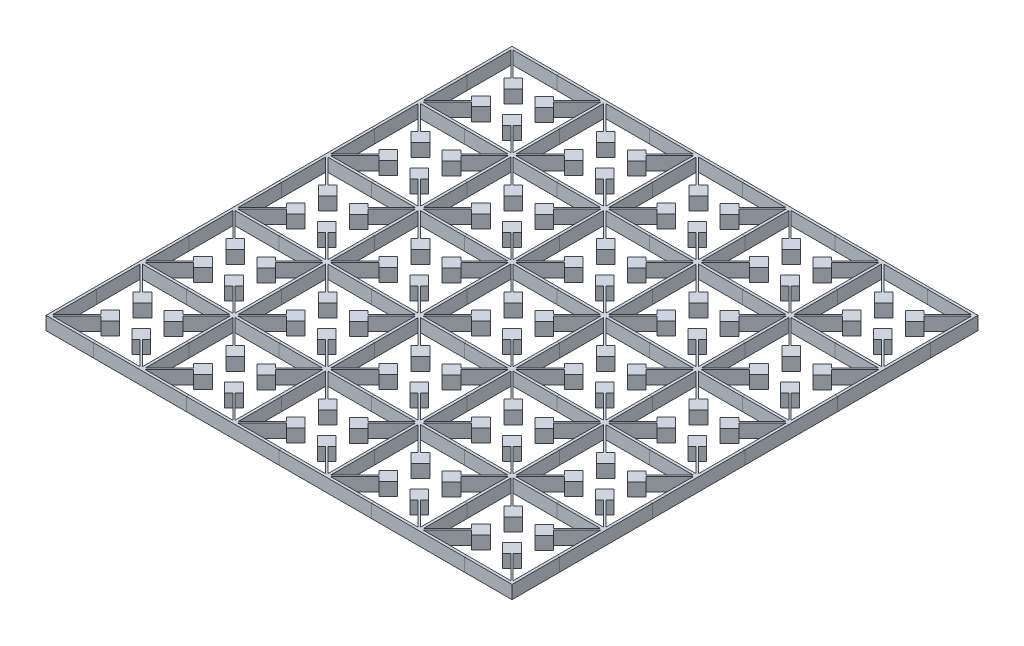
from build123d import *

# Parameters (mm, degrees)
SKETCH1_W             = 35
SKETCH1_H             = 1
EXTRUDE_THIN1_DEPTH   = 5
SKETCH1_W_2           = 1
SKETCH1_H_2           = 35
EXTRUDE_THIN1_2_DEPTH = 5
EXTRUDE_THIN2_DEPTH   = 5
BOSS_EXTRUDE2_DEPTH   = 5
LPATTERN1_COUNT       = 2
LPATTERN1_PITCH       = 35
LPATTERN1_2_COUNT     = 2
LPATTERN1_2_PITCH     = 35
LPATTERN2_COUNT       = 5
LPATTERN2_PITCH       = 35
LPATTERN2_2_COUNT     = 5
LPATTERN2_2_PITCH     = 35
LPATTERN3_COUNT       = 5
LPATTERN3_PITCH       = 35
LPATTERN4_COUNT       = 5
LPATTERN4_PITCH       = 35
SKETCH6_OUTSIDE_W     = 271.406
SKETCH6_OUTSIDE_H     = 271.406
SKETCH6_OUTSIDE_W_2   = 176
SKETCH6_OUTSIDE_H_2   = 176
CUT_EXTRUDE1_DEPTH    = 485


with BuildPart() as part:
    # Sketch1 → Extrude-Thin1 (new body)
    with BuildSketch(Plane(origin=(0, 0, 0), x_dir=(1, 0, 0), z_dir=(0, 1, 0))):
        Rectangle(SKETCH1_W, SKETCH1_H)
    extrude(amount=EXTRUDE_THIN1_DEPTH)



with BuildPart() as body_2:
    # Sketch1 → Extrude-Thin1 2 (new body)
    with BuildSketch(Plane(origin=(0, 0, 0), x_dir=(1, 0, 0), z_dir=(0, 1, 0))):
        Rectangle(SKETCH1_W_2, SKETCH1_H_2)
    extrude(amount=EXTRUDE_THIN1_2_DEPTH)


with BuildPart() as part_1:
    add(part.part)

    add(body_2.part)  # Extrude-Thin2 merges body 2
    # Sketch3 → Extrude-Thin2 (add)
    with BuildSketch(Plane(origin=(0, 0, 0), x_dir=(1, 0, 0), z_dir=(0, 1, 0))):
        Polygon((-10.108091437, 9.662614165), (9.662614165, -10.108091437), (10.108091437, -9.662614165), (-9.662614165, 10.108091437), align=None)
        Polygon((-9.662614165, -10.108091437), (10.108091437, 9.662614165), (9.662614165, 10.108091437), (-10.108091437, -9.662614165), align=None)
    extrude(amount=EXTRUDE_THIN2_DEPTH)

    # Sketch4 → Boss-Extrude2 (add)
    with BuildSketch(Plane.XZ):
        Polygon((8.340324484, 11.430381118), (11.87585839, 14.965915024), (15.411392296, 11.430381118), (11.87585839, 7.894847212), align=None)
        Polygon((11.653119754, -8.117585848), (15.18865366, -11.653119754), (11.653119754, -15.18865366), (8.117585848, -11.653119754), align=None)
        Polygon((-7.894847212, -11.430381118), (-11.430381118, -14.965915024), (-14.965915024, -11.430381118), (-11.430381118, -7.894847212), align=None)
        Polygon((-11.207642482, 8.117585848), (-14.743176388, 11.653119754), (-11.207642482, 15.18865366), (-7.672108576, 11.653119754), align=None)
    extrude(amount=-BOSS_EXTRUDE2_DEPTH)


with BuildPart() as lpattern1_1:
    # LPattern1: pattern copy
    add(part_1.part.moved(Location(Vector(-1, 0, 0) * (1 * LPATTERN1_PITCH))))


with BuildPart() as lpattern1_2_1:
    # LPattern1 2: pattern copy
    add(part_1.part.moved(Location(Vector(0, 0, -1) * (1 * LPATTERN1_2_PITCH))))


with BuildPart() as lpattern1_2_2:
    # LPattern1 2: pattern copy
    add(lpattern1_1.part.moved(Location(Vector(0, 0, -1) * (1 * LPATTERN1_2_PITCH))))


with BuildPart() as lpattern2_1:
    # LPattern2: pattern copy
    add(part_1.part.moved(Location(Vector(1, 0, 0) * (1 * LPATTERN2_PITCH))))


with BuildPart() as lpattern2_2:
    # LPattern2: pattern copy
    add(part_1.part.moved(Location(Vector(1, 0, 0) * (2 * LPATTERN2_PITCH))))


with BuildPart() as lpattern2_3:
    # LPattern2: pattern copy
    add(part_1.part.moved(Location(Vector(1, 0, 0) * (3 * LPATTERN2_PITCH))))


with BuildPart() as lpattern2_4:
    # LPattern2: pattern copy
    add(part_1.part.moved(Location(Vector(1, 0, 0) * (4 * LPATTERN2_PITCH))))


with BuildPart() as lpattern2_2_1:
    # LPattern2 2: pattern copy
    add(part_1.part.moved(Location(Vector(0, 0, 1) * (1 * LPATTERN2_2_PITCH))))


with BuildPart() as lpattern2_2_2:
    # LPattern2 2: pattern copy
    add(part_1.part.moved(Location(Vector(0, 0, 1) * (2 * LPATTERN2_2_PITCH))))


with BuildPart() as lpattern2_2_3:
    # LPattern2 2: pattern copy
    add(part_1.part.moved(Location(Vector(0, 0, 1) * (3 * LPATTERN2_2_PITCH))))


with BuildPart() as lpattern2_2_4:
    # LPattern2 2: pattern copy
    add(part_1.part.moved(Location(Vector(0, 0, 1) * (4 * LPATTERN2_2_PITCH))))


with BuildPart() as lpattern2_2_5:
    # LPattern2 2: pattern copy
    add(lpattern2_1.part.moved(Location(Vector(0, 0, 1) * (1 * LPATTERN2_2_PITCH))))


with BuildPart() as lpattern2_2_6:
    # LPattern2 2: pattern copy
    add(lpattern2_1.part.moved(Location(Vector(0, 0, 1) * (2 * LPATTERN2_2_PITCH))))


with BuildPart() as lpattern2_2_7:
    # LPattern2 2: pattern copy
    add(lpattern2_1.part.moved(Location(Vector(0, 0, 1) * (3 * LPATTERN2_2_PITCH))))


with BuildPart() as lpattern2_2_8:
    # LPattern2 2: pattern copy
    add(lpattern2_1.part.moved(Location(Vector(0, 0, 1) * (4 * LPATTERN2_2_PITCH))))


with BuildPart() as lpattern2_2_9:
    # LPattern2 2: pattern copy
    add(lpattern2_2.part.moved(Location(Vector(0, 0, 1) * (1 * LPATTERN2_2_PITCH))))


with BuildPart() as lpattern2_2_10:
    # LPattern2 2: pattern copy
    add(lpattern2_2.part.moved(Location(Vector(0, 0, 1) * (2 * LPATTERN2_2_PITCH))))


with BuildPart() as lpattern2_2_11:
    # LPattern2 2: pattern copy
    add(lpattern2_2.part.moved(Location(Vector(0, 0, 1) * (3 * LPATTERN2_2_PITCH))))


with BuildPart() as lpattern2_2_12:
    # LPattern2 2: pattern copy
    add(lpattern2_2.part.moved(Location(Vector(0, 0, 1) * (4 * LPATTERN2_2_PITCH))))


with BuildPart() as lpattern2_2_13:
    # LPattern2 2: pattern copy
    add(lpattern2_3.part.moved(Location(Vector(0, 0, 1) * (1 * LPATTERN2_2_PITCH))))


with BuildPart() as lpattern2_2_14:
    # LPattern2 2: pattern copy
    add(lpattern2_3.part.moved(Location(Vector(0, 0, 1) * (2 * LPATTERN2_2_PITCH))))


with BuildPart() as lpattern2_2_15:
    # LPattern2 2: pattern copy
    add(lpattern2_3.part.moved(Location(Vector(0, 0, 1) * (3 * LPATTERN2_2_PITCH))))


with BuildPart() as lpattern2_2_16:
    # LPattern2 2: pattern copy
    add(lpattern2_3.part.moved(Location(Vector(0, 0, 1) * (4 * LPATTERN2_2_PITCH))))


with BuildPart() as lpattern2_2_17:
    # LPattern2 2: pattern copy
    add(lpattern2_4.part.moved(Location(Vector(0, 0, 1) * (1 * LPATTERN2_2_PITCH))))


with BuildPart() as lpattern2_2_18:
    # LPattern2 2: pattern copy
    add(lpattern2_4.part.moved(Location(Vector(0, 0, 1) * (2 * LPATTERN2_2_PITCH))))


with BuildPart() as lpattern2_2_19:
    # LPattern2 2: pattern copy
    add(lpattern2_4.part.moved(Location(Vector(0, 0, 1) * (3 * LPATTERN2_2_PITCH))))


with BuildPart() as lpattern2_2_20:
    # LPattern2 2: pattern copy
    add(lpattern2_4.part.moved(Location(Vector(0, 0, 1) * (4 * LPATTERN2_2_PITCH))))


with BuildPart() as lpattern3_1:
    # LPattern3: pattern copy
    add(lpattern1_2_1.part.moved(Location(Vector(1, 0, 0) * (1 * LPATTERN3_PITCH))))


with BuildPart() as lpattern3_2:
    # LPattern3: pattern copy
    add(lpattern1_2_1.part.moved(Location(Vector(1, 0, 0) * (2 * LPATTERN3_PITCH))))


with BuildPart() as lpattern3_3:
    # LPattern3: pattern copy
    add(lpattern1_2_1.part.moved(Location(Vector(1, 0, 0) * (3 * LPATTERN3_PITCH))))


with BuildPart() as lpattern3_4:
    # LPattern3: pattern copy
    add(lpattern1_2_1.part.moved(Location(Vector(1, 0, 0) * (4 * LPATTERN3_PITCH))))


with BuildPart() as lpattern4_1:
    # LPattern4: pattern copy
    add(lpattern1_1.part.moved(Location(Vector(0, 0, 1) * (1 * LPATTERN4_PITCH))))


with BuildPart() as lpattern4_2:
    # LPattern4: pattern copy
    add(lpattern1_1.part.moved(Location(Vector(0, 0, 1) * (2 * LPATTERN4_PITCH))))


with BuildPart() as lpattern4_3:
    # LPattern4: pattern copy
    add(lpattern1_1.part.moved(Location(Vector(0, 0, 1) * (3 * LPATTERN4_PITCH))))


with BuildPart() as lpattern4_4:
    # LPattern4: pattern copy
    add(lpattern1_1.part.moved(Location(Vector(0, 0, 1) * (4 * LPATTERN4_PITCH))))


with BuildPart() as cut_extrude1_tool:
    # Sketch6 outside → Cut-Extrude1 (new body)
    with BuildSketch(Plane(origin=(0, 0, 0), x_dir=(1, 0, 0), z_dir=(0, 1, 0))):
        with Locations((52.5, -52.5)):
            Rectangle(SKETCH6_OUTSIDE_W, SKETCH6_OUTSIDE_H)
        with Locations((52.5, -52.5)):
            Rectangle(SKETCH6_OUTSIDE_W_2, SKETCH6_OUTSIDE_H_2, mode=Mode.SUBTRACT)
    extrude(amount=CUT_EXTRUDE1_DEPTH)


with BuildPart() as lpattern1_1_1:
    add(lpattern1_1.part)

    # Cut-Extrude1: cut by cut_extrude1_tool
    add(cut_extrude1_tool.part, mode=Mode.SUBTRACT)


with BuildPart() as lpattern1_2_1_1:
    add(lpattern1_2_1.part)

    # Cut-Extrude1: cut by cut_extrude1_tool
    add(cut_extrude1_tool.part, mode=Mode.SUBTRACT)


with BuildPart() as lpattern1_2_2_1:
    add(lpattern1_2_2.part)

    # Cut-Extrude1: cut by cut_extrude1_tool
    add(cut_extrude1_tool.part, mode=Mode.SUBTRACT)


with BuildPart() as lpattern2_4_1:
    add(lpattern2_4.part)

    # Cut-Extrude1: cut by cut_extrude1_tool
    add(cut_extrude1_tool.part, mode=Mode.SUBTRACT)


with BuildPart() as lpattern2_2_4_1:
    add(lpattern2_2_4.part)

    # Cut-Extrude1: cut by cut_extrude1_tool
    add(cut_extrude1_tool.part, mode=Mode.SUBTRACT)


with BuildPart() as lpattern2_2_8_1:
    add(lpattern2_2_8.part)

    # Cut-Extrude1: cut by cut_extrude1_tool
    add(cut_extrude1_tool.part, mode=Mode.SUBTRACT)


with BuildPart() as lpattern2_2_12_1:
    add(lpattern2_2_12.part)

    # Cut-Extrude1: cut by cut_extrude1_tool
    add(cut_extrude1_tool.part, mode=Mode.SUBTRACT)


with BuildPart() as lpattern2_2_16_1:
    add(lpattern2_2_16.part)

    # Cut-Extrude1: cut by cut_extrude1_tool
    add(cut_extrude1_tool.part, mode=Mode.SUBTRACT)


with BuildPart() as lpattern2_2_17_1:
    add(lpattern2_2_17.part)

    # Cut-Extrude1: cut by cut_extrude1_tool
    add(cut_extrude1_tool.part, mode=Mode.SUBTRACT)


with BuildPart() as lpattern2_2_18_1:
    add(lpattern2_2_18.part)

    # Cut-Extrude1: cut by cut_extrude1_tool
    add(cut_extrude1_tool.part, mode=Mode.SUBTRACT)


with BuildPart() as lpattern2_2_19_1:
    add(lpattern2_2_19.part)

    # Cut-Extrude1: cut by cut_extrude1_tool
    add(cut_extrude1_tool.part, mode=Mode.SUBTRACT)


with BuildPart() as lpattern2_2_20_1:
    add(lpattern2_2_20.part)

    # Cut-Extrude1: cut by cut_extrude1_tool
    add(cut_extrude1_tool.part, mode=Mode.SUBTRACT)


with BuildPart() as lpattern3_1_1:
    add(lpattern3_1.part)

    # Cut-Extrude1: cut by cut_extrude1_tool
    add(cut_extrude1_tool.part, mode=Mode.SUBTRACT)


with BuildPart() as lpattern3_2_1:
    add(lpattern3_2.part)

    # Cut-Extrude1: cut by cut_extrude1_tool
    add(cut_extrude1_tool.part, mode=Mode.SUBTRACT)


with BuildPart() as lpattern3_3_1:
    add(lpattern3_3.part)

    # Cut-Extrude1: cut by cut_extrude1_tool
    add(cut_extrude1_tool.part, mode=Mode.SUBTRACT)


with BuildPart() as lpattern3_4_1:
    add(lpattern3_4.part)

    # Cut-Extrude1: cut by cut_extrude1_tool
    add(cut_extrude1_tool.part, mode=Mode.SUBTRACT)


with BuildPart() as lpattern4_1_1:
    add(lpattern4_1.part)

    # Cut-Extrude1: cut by cut_extrude1_tool
    add(cut_extrude1_tool.part, mode=Mode.SUBTRACT)


with BuildPart() as lpattern4_2_1:
    add(lpattern4_2.part)

    # Cut-Extrude1: cut by cut_extrude1_tool
    add(cut_extrude1_tool.part, mode=Mode.SUBTRACT)


with BuildPart() as lpattern4_3_1:
    add(lpattern4_3.part)

    # Cut-Extrude1: cut by cut_extrude1_tool
    add(cut_extrude1_tool.part, mode=Mode.SUBTRACT)


with BuildPart() as lpattern4_4_1:
    add(lpattern4_4.part)

    # Cut-Extrude1: cut by cut_extrude1_tool
    add(cut_extrude1_tool.part, mode=Mode.SUBTRACT)


solid = Compound([part_1.part, lpattern2_1.part, lpattern2_2.part, lpattern2_3.part, lpattern2_2_1.part, lpattern2_2_2.part, lpattern2_2_3.part, lpattern2_2_5.part, lpattern2_2_6.part, lpattern2_2_7.part, lpattern2_2_9.part, lpattern2_2_10.part, lpattern2_2_11.part, lpattern2_2_13.part, lpattern2_2_14.part, lpattern2_2_15.part, lpattern1_1_1.part, lpattern1_2_1_1.part, lpattern1_2_2_1.part, lpattern2_4_1.part, lpattern2_2_4_1.part, lpattern2_2_8_1.part, lpattern2_2_12_1.part, lpattern2_2_16_1.part, lpattern2_2_17_1.part, lpattern2_2_18_1.part, lpattern2_2_19_1.part, lpattern2_2_20_1.part, lpattern3_1_1.part, lpattern3_2_1.part, lpattern3_3_1.part, lpattern3_4_1.part, lpattern4_1_1.part, lpattern4_2_1.part, lpattern4_3_1.part, lpattern4_4_1.part])
